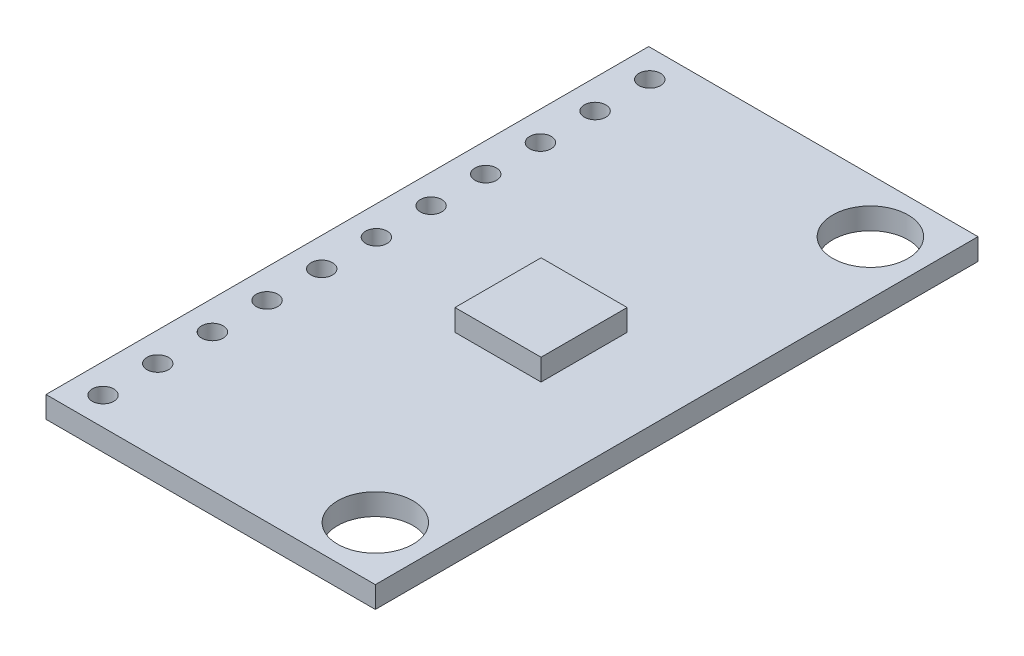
ISO-10303-21;
HEADER;
FILE_DESCRIPTION(('STEP AP214'),'2;1');
FILE_NAME('part.step','',(''),(''),'','','');
FILE_SCHEMA(('AUTOMOTIVE_DESIGN { 1 0 10303 214 1 1 1 1 }'));
ENDSEC;
DATA;
#1=APPLICATION_CONTEXT('core data for automotive mechanical design processes');
#2=APPLICATION_PROTOCOL_DEFINITION('international standard','automotive_design',2000,#1);
#3=PRODUCT_CONTEXT('',#1,'mechanical');
#4=PRODUCT('Part','Part','',(#3));
#5=PRODUCT_RELATED_PRODUCT_CATEGORY('part','',(#4));
#6=PRODUCT_DEFINITION_FORMATION('','',#4);
#7=PRODUCT_DEFINITION_CONTEXT('part definition',#1,'design');
#8=PRODUCT_DEFINITION('design','',#6,#7);
#9=PRODUCT_DEFINITION_SHAPE('','',#8);
#10=(LENGTH_UNIT() NAMED_UNIT(*) SI_UNIT(.MILLI.,.METRE.));
#11=(NAMED_UNIT(*) PLANE_ANGLE_UNIT() SI_UNIT($,.RADIAN.));
#12=(NAMED_UNIT(*) SI_UNIT($,.STERADIAN.) SOLID_ANGLE_UNIT());
#13=UNCERTAINTY_MEASURE_WITH_UNIT(LENGTH_MEASURE(1.E-05),#10,'distance_accuracy_value','');
#14=(GEOMETRIC_REPRESENTATION_CONTEXT(3) GLOBAL_UNCERTAINTY_ASSIGNED_CONTEXT((#13)) GLOBAL_UNIT_ASSIGNED_CONTEXT((#10,
#11,#12)) REPRESENTATION_CONTEXT('',''));
#15=CARTESIAN_POINT('',(0.,0.,0.));
#16=DIRECTION('',(0.,0.,1.));
#17=DIRECTION('',(1.,0.,0.));
#18=AXIS2_PLACEMENT_3D('',#15,#16,#17);
#19=CARTESIAN_POINT('',(0.,1.,0.));
#20=DIRECTION('',(0.,-1.,0.));
#21=DIRECTION('',(0.,0.,-1.));
#22=AXIS2_PLACEMENT_3D('',#19,#20,#21);
#23=PLANE('',#22);
#24=CARTESIAN_POINT('',(-7.65000000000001,1.,2.54));
#25=DIRECTION('',(0.,1.,0.));
#26=DIRECTION('',(0.,0.,-1.));
#27=AXIS2_PLACEMENT_3D('',#24,#25,#26);
#28=CIRCLE('',#27,0.500000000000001);
#29=CARTESIAN_POINT('',(-7.65000000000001,1.,2.04));
#30=VERTEX_POINT('',#29);
#31=EDGE_CURVE('E122',#30,#30,#28,.T.);
#32=ORIENTED_EDGE('',*,*,#31,.F.);
#33=EDGE_LOOP('',(#32));
#34=FACE_BOUND('',#33,.T.);
#35=CARTESIAN_POINT('',(-7.65000000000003,1.,7.62));
#36=DIRECTION('',(0.,1.,0.));
#37=DIRECTION('',(0.,0.,-1.));
#38=AXIS2_PLACEMENT_3D('',#35,#36,#37);
#39=CIRCLE('',#38,0.500000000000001);
#40=CARTESIAN_POINT('',(-7.65000000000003,1.,7.12));
#41=VERTEX_POINT('',#40);
#42=EDGE_CURVE('E137',#41,#41,#39,.T.);
#43=ORIENTED_EDGE('',*,*,#42,.F.);
#44=EDGE_LOOP('',(#43));
#45=FACE_BOUND('',#44,.T.);
#46=CARTESIAN_POINT('',(-7.65000000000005,1.,12.7));
#47=DIRECTION('',(0.,1.,0.));
#48=DIRECTION('',(0.,0.,-1.));
#49=AXIS2_PLACEMENT_3D('',#46,#47,#48);
#50=CIRCLE('',#49,0.500000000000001);
#51=CARTESIAN_POINT('',(-7.65000000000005,1.,12.2));
#52=VERTEX_POINT('',#51);
#53=EDGE_CURVE('E149',#52,#52,#50,.T.);
#54=ORIENTED_EDGE('',*,*,#53,.F.);
#55=EDGE_LOOP('',(#54));
#56=FACE_BOUND('',#55,.T.);
#57=CARTESIAN_POINT('',(-7.65000000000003,1.,-10.16));
#58=DIRECTION('',(0.,1.,0.));
#59=DIRECTION('',(0.,0.,1.));
#60=AXIS2_PLACEMENT_3D('',#57,#58,#59);
#61=CIRCLE('',#60,0.500000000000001);
#62=CARTESIAN_POINT('',(-7.65000000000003,1.,-9.66));
#63=VERTEX_POINT('',#62);
#64=EDGE_CURVE('E161',#63,#63,#61,.T.);
#65=ORIENTED_EDGE('',*,*,#64,.F.);
#66=EDGE_LOOP('',(#65));
#67=FACE_BOUND('',#66,.T.);
#68=CARTESIAN_POINT('',(-7.65000000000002,1.,-5.08));
#69=DIRECTION('',(0.,1.,0.));
#70=DIRECTION('',(0.,0.,1.));
#71=AXIS2_PLACEMENT_3D('',#68,#69,#70);
#72=CIRCLE('',#71,0.500000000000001);
#73=CARTESIAN_POINT('',(-7.65000000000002,1.,-4.58));
#74=VERTEX_POINT('',#73);
#75=EDGE_CURVE('E173',#74,#74,#72,.T.);
#76=ORIENTED_EDGE('',*,*,#75,.F.);
#77=EDGE_LOOP('',(#76));
#78=FACE_BOUND('',#77,.T.);
#79=CARTESIAN_POINT('',(-7.65,1.,0.));
#80=DIRECTION('',(0.,1.,0.));
#81=DIRECTION('',(0.,0.,1.));
#82=AXIS2_PLACEMENT_3D('',#79,#80,#81);
#83=CIRCLE('',#82,0.500000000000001);
#84=CARTESIAN_POINT('',(-7.65,1.,0.500000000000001));
#85=VERTEX_POINT('',#84);
#86=EDGE_CURVE('E185',#85,#85,#83,.T.);
#87=ORIENTED_EDGE('',*,*,#86,.F.);
#88=EDGE_LOOP('',(#87));
#89=FACE_BOUND('',#88,.T.);
#90=CARTESIAN_POINT('',(3.8,1.,-11.5));
#91=DIRECTION('',(0.,1.,0.));
#92=DIRECTION('',(0.,0.,1.));
#93=AXIS2_PLACEMENT_3D('',#90,#91,#92);
#94=CIRCLE('',#93,1.75);
#95=CARTESIAN_POINT('',(3.8,1.,-9.75));
#96=VERTEX_POINT('',#95);
#97=EDGE_CURVE('E197',#96,#96,#94,.T.);
#98=ORIENTED_EDGE('',*,*,#97,.F.);
#99=EDGE_LOOP('',(#98));
#100=FACE_BOUND('',#99,.T.);
#101=DIRECTION('',(0.,0.,-1.));
#102=VECTOR('',#101,1.);
#103=CARTESIAN_POINT('',(6.3,1.,14.));
#104=LINE('',#103,#102);
#105=CARTESIAN_POINT('',(6.3,1.,14.));
#106=VERTEX_POINT('',#105);
#107=CARTESIAN_POINT('',(6.3,1.,-14.));
#108=VERTEX_POINT('',#107);
#109=EDGE_CURVE('E203',#106,#108,#104,.T.);
#110=ORIENTED_EDGE('',*,*,#109,.T.);
#111=DIRECTION('',(-1.,0.,0.));
#112=VECTOR('',#111,1.);
#113=CARTESIAN_POINT('',(-9.,1.,-14.));
#114=LINE('',#113,#112);
#115=CARTESIAN_POINT('',(-9.,1.,-14.));
#116=VERTEX_POINT('',#115);
#117=EDGE_CURVE('E206',#108,#116,#114,.T.);
#118=ORIENTED_EDGE('',*,*,#117,.T.);
#119=DIRECTION('',(0.,0.,1.));
#120=VECTOR('',#119,1.);
#121=CARTESIAN_POINT('',(-9.,1.,14.));
#122=LINE('',#121,#120);
#123=CARTESIAN_POINT('',(-9.,1.,14.));
#124=VERTEX_POINT('',#123);
#125=EDGE_CURVE('E209',#116,#124,#122,.T.);
#126=ORIENTED_EDGE('',*,*,#125,.T.);
#127=DIRECTION('',(1.,0.,0.));
#128=VECTOR('',#127,1.);
#129=CARTESIAN_POINT('',(-9.,1.,14.));
#130=LINE('',#129,#128);
#131=EDGE_CURVE('E211',#124,#106,#130,.T.);
#132=ORIENTED_EDGE('',*,*,#131,.T.);
#133=EDGE_LOOP('',(#110,#118,#126,#132));
#134=FACE_BOUND('',#133,.T.);
#135=CARTESIAN_POINT('',(3.79999999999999,1.,11.5));
#136=DIRECTION('',(0.,1.,0.));
#137=DIRECTION('',(0.,0.,-1.));
#138=AXIS2_PLACEMENT_3D('',#135,#136,#137);
#139=CIRCLE('',#138,1.75);
#140=CARTESIAN_POINT('',(3.79999999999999,1.,9.75));
#141=VERTEX_POINT('',#140);
#142=EDGE_CURVE('E191',#141,#141,#139,.T.);
#143=ORIENTED_EDGE('',*,*,#142,.F.);
#144=EDGE_LOOP('',(#143));
#145=FACE_BOUND('',#144,.T.);
#146=CARTESIAN_POINT('',(-7.65000000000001,1.,-2.54));
#147=DIRECTION('',(0.,1.,0.));
#148=DIRECTION('',(0.,0.,1.));
#149=AXIS2_PLACEMENT_3D('',#146,#147,#148);
#150=CIRCLE('',#149,0.500000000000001);
#151=CARTESIAN_POINT('',(-7.65000000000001,1.,-2.04));
#152=VERTEX_POINT('',#151);
#153=EDGE_CURVE('E179',#152,#152,#150,.T.);
#154=ORIENTED_EDGE('',*,*,#153,.F.);
#155=EDGE_LOOP('',(#154));
#156=FACE_BOUND('',#155,.T.);
#157=CARTESIAN_POINT('',(-7.65000000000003,1.,-7.62));
#158=DIRECTION('',(0.,1.,0.));
#159=DIRECTION('',(0.,0.,1.));
#160=AXIS2_PLACEMENT_3D('',#157,#158,#159);
#161=CIRCLE('',#160,0.500000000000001);
#162=CARTESIAN_POINT('',(-7.65000000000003,1.,-7.12));
#163=VERTEX_POINT('',#162);
#164=EDGE_CURVE('E167',#163,#163,#161,.T.);
#165=ORIENTED_EDGE('',*,*,#164,.F.);
#166=EDGE_LOOP('',(#165));
#167=FACE_BOUND('',#166,.T.);
#168=CARTESIAN_POINT('',(-7.65000000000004,1.,-12.7));
#169=DIRECTION('',(0.,1.,0.));
#170=DIRECTION('',(0.,0.,1.));
#171=AXIS2_PLACEMENT_3D('',#168,#169,#170);
#172=CIRCLE('',#171,0.500000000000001);
#173=CARTESIAN_POINT('',(-7.65000000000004,1.,-12.2));
#174=VERTEX_POINT('',#173);
#175=EDGE_CURVE('E155',#174,#174,#172,.T.);
#176=ORIENTED_EDGE('',*,*,#175,.F.);
#177=EDGE_LOOP('',(#176));
#178=FACE_BOUND('',#177,.T.);
#179=CARTESIAN_POINT('',(-7.65000000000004,1.,10.16));
#180=DIRECTION('',(0.,1.,0.));
#181=DIRECTION('',(0.,0.,-1.));
#182=AXIS2_PLACEMENT_3D('',#179,#180,#181);
#183=CIRCLE('',#182,0.500000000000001);
#184=CARTESIAN_POINT('',(-7.65000000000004,1.,9.66));
#185=VERTEX_POINT('',#184);
#186=EDGE_CURVE('E143',#185,#185,#183,.T.);
#187=ORIENTED_EDGE('',*,*,#186,.F.);
#188=EDGE_LOOP('',(#187));
#189=FACE_BOUND('',#188,.T.);
#190=CARTESIAN_POINT('',(-7.65000000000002,1.,5.08));
#191=DIRECTION('',(0.,1.,0.));
#192=DIRECTION('',(0.,0.,-1.));
#193=AXIS2_PLACEMENT_3D('',#190,#191,#192);
#194=CIRCLE('',#193,0.500000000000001);
#195=CARTESIAN_POINT('',(-7.65000000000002,1.,4.58));
#196=VERTEX_POINT('',#195);
#197=EDGE_CURVE('E131',#196,#196,#194,.T.);
#198=ORIENTED_EDGE('',*,*,#197,.F.);
#199=EDGE_LOOP('',(#198));
#200=FACE_BOUND('',#199,.T.);
#201=DIRECTION('',(0.,0.,-1.));
#202=VECTOR('',#201,1.);
#203=CARTESIAN_POINT('',(2.,1.,-2.));
#204=LINE('',#203,#202);
#205=CARTESIAN_POINT('',(2.,1.,2.));
#206=VERTEX_POINT('',#205);
#207=CARTESIAN_POINT('',(2.,1.,-2.));
#208=VERTEX_POINT('',#207);
#209=EDGE_CURVE('E118',#206,#208,#204,.T.);
#210=ORIENTED_EDGE('',*,*,#209,.F.);
#211=DIRECTION('',(1.,0.,0.));
#212=VECTOR('',#211,1.);
#213=CARTESIAN_POINT('',(-2.,1.,2.));
#214=LINE('',#213,#212);
#215=CARTESIAN_POINT('',(-2.,1.,2.));
#216=VERTEX_POINT('',#215);
#217=EDGE_CURVE('E115',#216,#206,#214,.T.);
#218=ORIENTED_EDGE('',*,*,#217,.F.);
#219=DIRECTION('',(0.,0.,1.));
#220=VECTOR('',#219,1.);
#221=CARTESIAN_POINT('',(-2.,1.,-2.));
#222=LINE('',#221,#220);
#223=CARTESIAN_POINT('',(-2.,1.,-2.));
#224=VERTEX_POINT('',#223);
#225=EDGE_CURVE('E53',#224,#216,#222,.T.);
#226=ORIENTED_EDGE('',*,*,#225,.F.);
#227=DIRECTION('',(-1.,0.,0.));
#228=VECTOR('',#227,1.);
#229=CARTESIAN_POINT('',(-2.,1.,-2.));
#230=LINE('',#229,#228);
#231=EDGE_CURVE('E48',#208,#224,#230,.T.);
#232=ORIENTED_EDGE('',*,*,#231,.F.);
#233=EDGE_LOOP('',(#210,#218,#226,#232));
#234=FACE_BOUND('',#233,.T.);
#235=ADVANCED_FACE('F33',(#34,#45,#56,#67,#78,#89,#100,#134,#145,#156,#167,#178,#189,#200,#234),
#23,.F.);
#236=CARTESIAN_POINT('',(0.,0.,0.));
#237=DIRECTION('',(0.,-1.,0.));
#238=DIRECTION('',(0.,0.,-1.));
#239=AXIS2_PLACEMENT_3D('',#236,#237,#238);
#240=PLANE('',#239);
#241=CARTESIAN_POINT('',(-7.65000000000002,0.,5.08));
#242=DIRECTION('',(0.,1.,0.));
#243=DIRECTION('',(0.,0.,-1.));
#244=AXIS2_PLACEMENT_3D('',#241,#242,#243);
#245=CIRCLE('',#244,0.500000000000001);
#246=CARTESIAN_POINT('',(-7.65000000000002,0.,4.58));
#247=VERTEX_POINT('',#246);
#248=EDGE_CURVE('E129',#247,#247,#245,.T.);
#249=ORIENTED_EDGE('',*,*,#248,.T.);
#250=EDGE_LOOP('',(#249));
#251=FACE_BOUND('',#250,.T.);
#252=CARTESIAN_POINT('',(-7.65000000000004,0.,10.16));
#253=DIRECTION('',(0.,1.,0.));
#254=DIRECTION('',(0.,0.,-1.));
#255=AXIS2_PLACEMENT_3D('',#252,#253,#254);
#256=CIRCLE('',#255,0.500000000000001);
#257=CARTESIAN_POINT('',(-7.65000000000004,0.,9.66));
#258=VERTEX_POINT('',#257);
#259=EDGE_CURVE('E140',#258,#258,#256,.T.);
#260=ORIENTED_EDGE('',*,*,#259,.T.);
#261=EDGE_LOOP('',(#260));
#262=FACE_BOUND('',#261,.T.);
#263=CARTESIAN_POINT('',(-7.65000000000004,0.,-12.7));
#264=DIRECTION('',(0.,1.,0.));
#265=DIRECTION('',(0.,0.,1.));
#266=AXIS2_PLACEMENT_3D('',#263,#264,#265);
#267=CIRCLE('',#266,0.500000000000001);
#268=CARTESIAN_POINT('',(-7.65000000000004,0.,-12.2));
#269=VERTEX_POINT('',#268);
#270=EDGE_CURVE('E152',#269,#269,#267,.T.);
#271=ORIENTED_EDGE('',*,*,#270,.T.);
#272=EDGE_LOOP('',(#271));
#273=FACE_BOUND('',#272,.T.);
#274=CARTESIAN_POINT('',(-7.65000000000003,0.,-7.62));
#275=DIRECTION('',(0.,1.,0.));
#276=DIRECTION('',(0.,0.,1.));
#277=AXIS2_PLACEMENT_3D('',#274,#275,#276);
#278=CIRCLE('',#277,0.500000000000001);
#279=CARTESIAN_POINT('',(-7.65000000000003,0.,-7.12));
#280=VERTEX_POINT('',#279);
#281=EDGE_CURVE('E164',#280,#280,#278,.T.);
#282=ORIENTED_EDGE('',*,*,#281,.T.);
#283=EDGE_LOOP('',(#282));
#284=FACE_BOUND('',#283,.T.);
#285=CARTESIAN_POINT('',(-7.65000000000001,0.,-2.54));
#286=DIRECTION('',(0.,1.,0.));
#287=DIRECTION('',(0.,0.,1.));
#288=AXIS2_PLACEMENT_3D('',#285,#286,#287);
#289=CIRCLE('',#288,0.500000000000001);
#290=CARTESIAN_POINT('',(-7.65000000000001,0.,-2.04));
#291=VERTEX_POINT('',#290);
#292=EDGE_CURVE('E176',#291,#291,#289,.T.);
#293=ORIENTED_EDGE('',*,*,#292,.T.);
#294=EDGE_LOOP('',(#293));
#295=FACE_BOUND('',#294,.T.);
#296=CARTESIAN_POINT('',(3.79999999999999,0.,11.5));
#297=DIRECTION('',(0.,1.,0.));
#298=DIRECTION('',(0.,0.,-1.));
#299=AXIS2_PLACEMENT_3D('',#296,#297,#298);
#300=CIRCLE('',#299,1.75);
#301=CARTESIAN_POINT('',(3.79999999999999,0.,9.75));
#302=VERTEX_POINT('',#301);
#303=EDGE_CURVE('E188',#302,#302,#300,.T.);
#304=ORIENTED_EDGE('',*,*,#303,.T.);
#305=EDGE_LOOP('',(#304));
#306=FACE_BOUND('',#305,.T.);
#307=DIRECTION('',(0.,0.,-1.));
#308=VECTOR('',#307,1.);
#309=CARTESIAN_POINT('',(6.3,0.,14.));
#310=LINE('',#309,#308);
#311=CARTESIAN_POINT('',(6.3,0.,14.));
#312=VERTEX_POINT('',#311);
#313=CARTESIAN_POINT('',(6.3,0.,-14.));
#314=VERTEX_POINT('',#313);
#315=EDGE_CURVE('E200',#312,#314,#310,.T.);
#316=ORIENTED_EDGE('',*,*,#315,.F.);
#317=DIRECTION('',(1.,0.,0.));
#318=VECTOR('',#317,1.);
#319=CARTESIAN_POINT('',(-9.,0.,14.));
#320=LINE('',#319,#318);
#321=CARTESIAN_POINT('',(-9.,0.,14.));
#322=VERTEX_POINT('',#321);
#323=EDGE_CURVE('E207',#322,#312,#320,.T.);
#324=ORIENTED_EDGE('',*,*,#323,.F.);
#325=DIRECTION('',(0.,0.,1.));
#326=VECTOR('',#325,1.);
#327=CARTESIAN_POINT('',(-9.,0.,14.));
#328=LINE('',#327,#326);
#329=CARTESIAN_POINT('',(-9.,0.,-14.));
#330=VERTEX_POINT('',#329);
#331=EDGE_CURVE('E218',#330,#322,#328,.T.);
#332=ORIENTED_EDGE('',*,*,#331,.F.);
#333=DIRECTION('',(-1.,0.,0.));
#334=VECTOR('',#333,1.);
#335=CARTESIAN_POINT('',(-9.,0.,-14.));
#336=LINE('',#335,#334);
#337=EDGE_CURVE('E216',#314,#330,#336,.T.);
#338=ORIENTED_EDGE('',*,*,#337,.F.);
#339=EDGE_LOOP('',(#316,#324,#332,#338));
#340=FACE_BOUND('',#339,.T.);
#341=CARTESIAN_POINT('',(3.8,0.,-11.5));
#342=DIRECTION('',(0.,1.,0.));
#343=DIRECTION('',(0.,0.,1.));
#344=AXIS2_PLACEMENT_3D('',#341,#342,#343);
#345=CIRCLE('',#344,1.75);
#346=CARTESIAN_POINT('',(3.8,0.,-9.75));
#347=VERTEX_POINT('',#346);
#348=EDGE_CURVE('E194',#347,#347,#345,.T.);
#349=ORIENTED_EDGE('',*,*,#348,.T.);
#350=EDGE_LOOP('',(#349));
#351=FACE_BOUND('',#350,.T.);
#352=CARTESIAN_POINT('',(-7.65,0.,0.));
#353=DIRECTION('',(0.,1.,0.));
#354=DIRECTION('',(0.,0.,1.));
#355=AXIS2_PLACEMENT_3D('',#352,#353,#354);
#356=CIRCLE('',#355,0.500000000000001);
#357=CARTESIAN_POINT('',(-7.65,0.,0.500000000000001));
#358=VERTEX_POINT('',#357);
#359=EDGE_CURVE('E182',#358,#358,#356,.T.);
#360=ORIENTED_EDGE('',*,*,#359,.T.);
#361=EDGE_LOOP('',(#360));
#362=FACE_BOUND('',#361,.T.);
#363=CARTESIAN_POINT('',(-7.65000000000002,0.,-5.08));
#364=DIRECTION('',(0.,1.,0.));
#365=DIRECTION('',(0.,0.,1.));
#366=AXIS2_PLACEMENT_3D('',#363,#364,#365);
#367=CIRCLE('',#366,0.500000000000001);
#368=CARTESIAN_POINT('',(-7.65000000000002,0.,-4.58));
#369=VERTEX_POINT('',#368);
#370=EDGE_CURVE('E170',#369,#369,#367,.T.);
#371=ORIENTED_EDGE('',*,*,#370,.T.);
#372=EDGE_LOOP('',(#371));
#373=FACE_BOUND('',#372,.T.);
#374=CARTESIAN_POINT('',(-7.65000000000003,0.,-10.16));
#375=DIRECTION('',(0.,1.,0.));
#376=DIRECTION('',(0.,0.,1.));
#377=AXIS2_PLACEMENT_3D('',#374,#375,#376);
#378=CIRCLE('',#377,0.500000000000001);
#379=CARTESIAN_POINT('',(-7.65000000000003,0.,-9.66));
#380=VERTEX_POINT('',#379);
#381=EDGE_CURVE('E158',#380,#380,#378,.T.);
#382=ORIENTED_EDGE('',*,*,#381,.T.);
#383=EDGE_LOOP('',(#382));
#384=FACE_BOUND('',#383,.T.);
#385=CARTESIAN_POINT('',(-7.65000000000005,0.,12.7));
#386=DIRECTION('',(0.,1.,0.));
#387=DIRECTION('',(0.,0.,-1.));
#388=AXIS2_PLACEMENT_3D('',#385,#386,#387);
#389=CIRCLE('',#388,0.500000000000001);
#390=CARTESIAN_POINT('',(-7.65000000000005,0.,12.2));
#391=VERTEX_POINT('',#390);
#392=EDGE_CURVE('E146',#391,#391,#389,.T.);
#393=ORIENTED_EDGE('',*,*,#392,.T.);
#394=EDGE_LOOP('',(#393));
#395=FACE_BOUND('',#394,.T.);
#396=CARTESIAN_POINT('',(-7.65000000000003,0.,7.62));
#397=DIRECTION('',(0.,1.,0.));
#398=DIRECTION('',(0.,0.,-1.));
#399=AXIS2_PLACEMENT_3D('',#396,#397,#398);
#400=CIRCLE('',#399,0.500000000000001);
#401=CARTESIAN_POINT('',(-7.65000000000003,0.,7.12));
#402=VERTEX_POINT('',#401);
#403=EDGE_CURVE('E134',#402,#402,#400,.T.);
#404=ORIENTED_EDGE('',*,*,#403,.T.);
#405=EDGE_LOOP('',(#404));
#406=FACE_BOUND('',#405,.T.);
#407=CARTESIAN_POINT('',(-7.65000000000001,0.,2.54));
#408=DIRECTION('',(0.,1.,0.));
#409=DIRECTION('',(0.,0.,-1.));
#410=AXIS2_PLACEMENT_3D('',#407,#408,#409);
#411=CIRCLE('',#410,0.500000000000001);
#412=CARTESIAN_POINT('',(-7.65000000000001,0.,2.04));
#413=VERTEX_POINT('',#412);
#414=EDGE_CURVE('E119',#413,#413,#411,.T.);
#415=ORIENTED_EDGE('',*,*,#414,.T.);
#416=EDGE_LOOP('',(#415));
#417=FACE_BOUND('',#416,.T.);
#418=ADVANCED_FACE('F236',(#251,#262,#273,#284,#295,#306,#340,#351,#362,#373,#384,#395,#406,
#417),#240,.T.);
#419=CARTESIAN_POINT('',(6.3,1.,14.));
#420=DIRECTION('',(-1.,0.,0.));
#421=DIRECTION('',(0.,0.,1.));
#422=AXIS2_PLACEMENT_3D('',#419,#420,#421);
#423=PLANE('',#422);
#424=ORIENTED_EDGE('',*,*,#315,.T.);
#425=DIRECTION('',(0.,-1.,0.));
#426=VECTOR('',#425,1.);
#427=CARTESIAN_POINT('',(6.3,1.,-14.));
#428=LINE('',#427,#426);
#429=EDGE_CURVE('E11',#108,#314,#428,.T.);
#430=ORIENTED_EDGE('',*,*,#429,.F.);
#431=ORIENTED_EDGE('',*,*,#109,.F.);
#432=DIRECTION('',(0.,-1.,0.));
#433=VECTOR('',#432,1.);
#434=CARTESIAN_POINT('',(6.3,1.,14.));
#435=LINE('',#434,#433);
#436=EDGE_CURVE('E213',#106,#312,#435,.T.);
#437=ORIENTED_EDGE('',*,*,#436,.T.);
#438=EDGE_LOOP('',(#424,#430,#431,#437));
#439=FACE_BOUND('',#438,.T.);
#440=ADVANCED_FACE('F35',(#439),#423,.F.);
#441=CARTESIAN_POINT('',(-9.,1.,-14.));
#442=DIRECTION('',(0.,0.,1.));
#443=DIRECTION('',(1.,0.,0.));
#444=AXIS2_PLACEMENT_3D('',#441,#442,#443);
#445=PLANE('',#444);
#446=ORIENTED_EDGE('',*,*,#337,.T.);
#447=DIRECTION('',(0.,-1.,0.));
#448=VECTOR('',#447,1.);
#449=CARTESIAN_POINT('',(-9.,1.,-14.));
#450=LINE('',#449,#448);
#451=EDGE_CURVE('E41',#116,#330,#450,.T.);
#452=ORIENTED_EDGE('',*,*,#451,.F.);
#453=ORIENTED_EDGE('',*,*,#117,.F.);
#454=ORIENTED_EDGE('',*,*,#429,.T.);
#455=EDGE_LOOP('',(#446,#452,#453,#454));
#456=FACE_BOUND('',#455,.T.);
#457=ADVANCED_FACE('F247',(#456),#445,.F.);
#458=CARTESIAN_POINT('',(-9.,1.,14.));
#459=DIRECTION('',(1.,0.,0.));
#460=DIRECTION('',(0.,0.,-1.));
#461=AXIS2_PLACEMENT_3D('',#458,#459,#460);
#462=PLANE('',#461);
#463=ORIENTED_EDGE('',*,*,#331,.T.);
#464=DIRECTION('',(0.,-1.,0.));
#465=VECTOR('',#464,1.);
#466=CARTESIAN_POINT('',(-9.,1.,14.));
#467=LINE('',#466,#465);
#468=EDGE_CURVE('E223',#124,#322,#467,.T.);
#469=ORIENTED_EDGE('',*,*,#468,.F.);
#470=ORIENTED_EDGE('',*,*,#125,.F.);
#471=ORIENTED_EDGE('',*,*,#451,.T.);
#472=EDGE_LOOP('',(#463,#469,#470,#471));
#473=FACE_BOUND('',#472,.T.);
#474=ADVANCED_FACE('F230',(#473),#462,.F.);
#475=CARTESIAN_POINT('',(-9.,1.,14.));
#476=DIRECTION('',(0.,0.,-1.));
#477=DIRECTION('',(-1.,0.,0.));
#478=AXIS2_PLACEMENT_3D('',#475,#476,#477);
#479=PLANE('',#478);
#480=ORIENTED_EDGE('',*,*,#323,.T.);
#481=ORIENTED_EDGE('',*,*,#436,.F.);
#482=ORIENTED_EDGE('',*,*,#131,.F.);
#483=ORIENTED_EDGE('',*,*,#468,.T.);
#484=EDGE_LOOP('',(#480,#481,#482,#483));
#485=FACE_BOUND('',#484,.T.);
#486=ADVANCED_FACE('F240',(#485),#479,.F.);
#487=CARTESIAN_POINT('',(3.8,1.,-11.5));
#488=DIRECTION('',(0.,-1.,0.));
#489=DIRECTION('',(0.,0.,-1.));
#490=AXIS2_PLACEMENT_3D('',#487,#488,#489);
#491=CYLINDRICAL_SURFACE('',#490,1.75);
#492=ORIENTED_EDGE('',*,*,#97,.T.);
#493=EDGE_LOOP('',(#492));
#494=FACE_BOUND('',#493,.T.);
#495=ORIENTED_EDGE('',*,*,#348,.F.);
#496=EDGE_LOOP('',(#495));
#497=FACE_BOUND('',#496,.T.);
#498=ADVANCED_FACE('F265',(#494,#497),#491,.F.);
#499=CARTESIAN_POINT('',(3.79999999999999,1.,11.5));
#500=DIRECTION('',(0.,-1.,0.));
#501=DIRECTION('',(0.,0.,-1.));
#502=AXIS2_PLACEMENT_3D('',#499,#500,#501);
#503=CYLINDRICAL_SURFACE('',#502,1.75);
#504=ORIENTED_EDGE('',*,*,#142,.T.);
#505=EDGE_LOOP('',(#504));
#506=FACE_BOUND('',#505,.T.);
#507=ORIENTED_EDGE('',*,*,#303,.F.);
#508=EDGE_LOOP('',(#507));
#509=FACE_BOUND('',#508,.T.);
#510=ADVANCED_FACE('F272',(#506,#509),#503,.F.);
#511=CARTESIAN_POINT('',(-7.65,1.,0.));
#512=DIRECTION('',(0.,-1.,0.));
#513=DIRECTION('',(0.,0.,-1.));
#514=AXIS2_PLACEMENT_3D('',#511,#512,#513);
#515=CYLINDRICAL_SURFACE('',#514,0.500000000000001);
#516=ORIENTED_EDGE('',*,*,#86,.T.);
#517=EDGE_LOOP('',(#516));
#518=FACE_BOUND('',#517,.T.);
#519=ORIENTED_EDGE('',*,*,#359,.F.);
#520=EDGE_LOOP('',(#519));
#521=FACE_BOUND('',#520,.T.);
#522=ADVANCED_FACE('F277',(#518,#521),#515,.F.);
#523=CARTESIAN_POINT('',(-7.65000000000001,1.,-2.54));
#524=DIRECTION('',(0.,-1.,0.));
#525=DIRECTION('',(0.,0.,-1.));
#526=AXIS2_PLACEMENT_3D('',#523,#524,#525);
#527=CYLINDRICAL_SURFACE('',#526,0.500000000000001);
#528=ORIENTED_EDGE('',*,*,#153,.T.);
#529=EDGE_LOOP('',(#528));
#530=FACE_BOUND('',#529,.T.);
#531=ORIENTED_EDGE('',*,*,#292,.F.);
#532=EDGE_LOOP('',(#531));
#533=FACE_BOUND('',#532,.T.);
#534=ADVANCED_FACE('F336',(#530,#533),#527,.F.);
#535=CARTESIAN_POINT('',(-7.65000000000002,1.,-5.08));
#536=DIRECTION('',(0.,-1.,0.));
#537=DIRECTION('',(0.,0.,-1.));
#538=AXIS2_PLACEMENT_3D('',#535,#536,#537);
#539=CYLINDRICAL_SURFACE('',#538,0.500000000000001);
#540=ORIENTED_EDGE('',*,*,#75,.T.);
#541=EDGE_LOOP('',(#540));
#542=FACE_BOUND('',#541,.T.);
#543=ORIENTED_EDGE('',*,*,#370,.F.);
#544=EDGE_LOOP('',(#543));
#545=FACE_BOUND('',#544,.T.);
#546=ADVANCED_FACE('F332',(#542,#545),#539,.F.);
#547=CARTESIAN_POINT('',(-7.65000000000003,1.,-7.62));
#548=DIRECTION('',(0.,-1.,0.));
#549=DIRECTION('',(0.,0.,-1.));
#550=AXIS2_PLACEMENT_3D('',#547,#548,#549);
#551=CYLINDRICAL_SURFACE('',#550,0.500000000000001);
#552=ORIENTED_EDGE('',*,*,#164,.T.);
#553=EDGE_LOOP('',(#552));
#554=FACE_BOUND('',#553,.T.);
#555=ORIENTED_EDGE('',*,*,#281,.F.);
#556=EDGE_LOOP('',(#555));
#557=FACE_BOUND('',#556,.T.);
#558=ADVANCED_FACE('F328',(#554,#557),#551,.F.);
#559=CARTESIAN_POINT('',(-7.65000000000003,1.,-10.16));
#560=DIRECTION('',(0.,-1.,0.));
#561=DIRECTION('',(0.,0.,-1.));
#562=AXIS2_PLACEMENT_3D('',#559,#560,#561);
#563=CYLINDRICAL_SURFACE('',#562,0.500000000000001);
#564=ORIENTED_EDGE('',*,*,#64,.T.);
#565=EDGE_LOOP('',(#564));
#566=FACE_BOUND('',#565,.T.);
#567=ORIENTED_EDGE('',*,*,#381,.F.);
#568=EDGE_LOOP('',(#567));
#569=FACE_BOUND('',#568,.T.);
#570=ADVANCED_FACE('F324',(#566,#569),#563,.F.);
#571=CARTESIAN_POINT('',(-7.65000000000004,1.,-12.7));
#572=DIRECTION('',(0.,-1.,0.));
#573=DIRECTION('',(0.,0.,-1.));
#574=AXIS2_PLACEMENT_3D('',#571,#572,#573);
#575=CYLINDRICAL_SURFACE('',#574,0.500000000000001);
#576=ORIENTED_EDGE('',*,*,#175,.T.);
#577=EDGE_LOOP('',(#576));
#578=FACE_BOUND('',#577,.T.);
#579=ORIENTED_EDGE('',*,*,#270,.F.);
#580=EDGE_LOOP('',(#579));
#581=FACE_BOUND('',#580,.T.);
#582=ADVANCED_FACE('F320',(#578,#581),#575,.F.);
#583=CARTESIAN_POINT('',(-7.65000000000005,1.,12.7));
#584=DIRECTION('',(0.,-1.,0.));
#585=DIRECTION('',(0.,0.,-1.));
#586=AXIS2_PLACEMENT_3D('',#583,#584,#585);
#587=CYLINDRICAL_SURFACE('',#586,0.500000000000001);
#588=ORIENTED_EDGE('',*,*,#53,.T.);
#589=EDGE_LOOP('',(#588));
#590=FACE_BOUND('',#589,.T.);
#591=ORIENTED_EDGE('',*,*,#392,.F.);
#592=EDGE_LOOP('',(#591));
#593=FACE_BOUND('',#592,.T.);
#594=ADVANCED_FACE('F316',(#590,#593),#587,.F.);
#595=CARTESIAN_POINT('',(-7.65000000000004,1.,10.16));
#596=DIRECTION('',(0.,-1.,0.));
#597=DIRECTION('',(0.,0.,-1.));
#598=AXIS2_PLACEMENT_3D('',#595,#596,#597);
#599=CYLINDRICAL_SURFACE('',#598,0.500000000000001);
#600=ORIENTED_EDGE('',*,*,#186,.T.);
#601=EDGE_LOOP('',(#600));
#602=FACE_BOUND('',#601,.T.);
#603=ORIENTED_EDGE('',*,*,#259,.F.);
#604=EDGE_LOOP('',(#603));
#605=FACE_BOUND('',#604,.T.);
#606=ADVANCED_FACE('F312',(#602,#605),#599,.F.);
#607=CARTESIAN_POINT('',(-7.65000000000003,1.,7.62));
#608=DIRECTION('',(0.,-1.,0.));
#609=DIRECTION('',(0.,0.,-1.));
#610=AXIS2_PLACEMENT_3D('',#607,#608,#609);
#611=CYLINDRICAL_SURFACE('',#610,0.500000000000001);
#612=ORIENTED_EDGE('',*,*,#42,.T.);
#613=EDGE_LOOP('',(#612));
#614=FACE_BOUND('',#613,.T.);
#615=ORIENTED_EDGE('',*,*,#403,.F.);
#616=EDGE_LOOP('',(#615));
#617=FACE_BOUND('',#616,.T.);
#618=ADVANCED_FACE('F305',(#614,#617),#611,.F.);
#619=CARTESIAN_POINT('',(-7.65000000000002,1.,5.08));
#620=DIRECTION('',(0.,-1.,0.));
#621=DIRECTION('',(0.,0.,-1.));
#622=AXIS2_PLACEMENT_3D('',#619,#620,#621);
#623=CYLINDRICAL_SURFACE('',#622,0.500000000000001);
#624=ORIENTED_EDGE('',*,*,#197,.T.);
#625=EDGE_LOOP('',(#624));
#626=FACE_BOUND('',#625,.T.);
#627=ORIENTED_EDGE('',*,*,#248,.F.);
#628=EDGE_LOOP('',(#627));
#629=FACE_BOUND('',#628,.T.);
#630=ADVANCED_FACE('F297',(#626,#629),#623,.F.);
#631=CARTESIAN_POINT('',(-7.65000000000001,1.,2.54));
#632=DIRECTION('',(0.,-1.,0.));
#633=DIRECTION('',(0.,0.,-1.));
#634=AXIS2_PLACEMENT_3D('',#631,#632,#633);
#635=CYLINDRICAL_SURFACE('',#634,0.500000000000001);
#636=ORIENTED_EDGE('',*,*,#31,.T.);
#637=EDGE_LOOP('',(#636));
#638=FACE_BOUND('',#637,.T.);
#639=ORIENTED_EDGE('',*,*,#414,.F.);
#640=EDGE_LOOP('',(#639));
#641=FACE_BOUND('',#640,.T.);
#642=ADVANCED_FACE('F295',(#638,#641),#635,.F.);
#643=CARTESIAN_POINT('',(2.,2.,-2.));
#644=DIRECTION('',(-1.,0.,0.));
#645=DIRECTION('',(0.,0.,1.));
#646=AXIS2_PLACEMENT_3D('',#643,#644,#645);
#647=PLANE('',#646);
#648=ORIENTED_EDGE('',*,*,#209,.T.);
#649=DIRECTION('',(0.,-1.,0.));
#650=VECTOR('',#649,1.);
#651=CARTESIAN_POINT('',(2.,2.,-2.));
#652=LINE('',#651,#650);
#653=CARTESIAN_POINT('',(2.,2.,-2.));
#654=VERTEX_POINT('',#653);
#655=EDGE_CURVE('E99',#654,#208,#652,.T.);
#656=ORIENTED_EDGE('',*,*,#655,.F.);
#657=DIRECTION('',(0.,0.,-1.));
#658=VECTOR('',#657,1.);
#659=CARTESIAN_POINT('',(2.,2.,-2.));
#660=LINE('',#659,#658);
#661=CARTESIAN_POINT('',(2.,2.,2.));
#662=VERTEX_POINT('',#661);
#663=EDGE_CURVE('E106',#662,#654,#660,.T.);
#664=ORIENTED_EDGE('',*,*,#663,.F.);
#665=DIRECTION('',(0.,-1.,0.));
#666=VECTOR('',#665,1.);
#667=CARTESIAN_POINT('',(2.,2.,2.));
#668=LINE('',#667,#666);
#669=EDGE_CURVE('E442',#662,#206,#668,.T.);
#670=ORIENTED_EDGE('',*,*,#669,.T.);
#671=EDGE_LOOP('',(#648,#656,#664,#670));
#672=FACE_BOUND('',#671,.T.);
#673=ADVANCED_FACE('F117',(#672),#647,.F.);
#674=CARTESIAN_POINT('',(-2.,2.,-2.));
#675=DIRECTION('',(0.,0.,1.));
#676=DIRECTION('',(1.,0.,0.));
#677=AXIS2_PLACEMENT_3D('',#674,#675,#676);
#678=PLANE('',#677);
#679=ORIENTED_EDGE('',*,*,#231,.T.);
#680=DIRECTION('',(0.,-1.,0.));
#681=VECTOR('',#680,1.);
#682=CARTESIAN_POINT('',(-2.,2.,-2.));
#683=LINE('',#682,#681);
#684=CARTESIAN_POINT('',(-2.,2.,-2.));
#685=VERTEX_POINT('',#684);
#686=EDGE_CURVE('E102',#685,#224,#683,.T.);
#687=ORIENTED_EDGE('',*,*,#686,.F.);
#688=DIRECTION('',(-1.,0.,0.));
#689=VECTOR('',#688,1.);
#690=CARTESIAN_POINT('',(-2.,2.,-2.));
#691=LINE('',#690,#689);
#692=EDGE_CURVE('E95',#654,#685,#691,.T.);
#693=ORIENTED_EDGE('',*,*,#692,.F.);
#694=ORIENTED_EDGE('',*,*,#655,.T.);
#695=EDGE_LOOP('',(#679,#687,#693,#694));
#696=FACE_BOUND('',#695,.T.);
#697=ADVANCED_FACE('F97',(#696),#678,.F.);
#698=CARTESIAN_POINT('',(-2.,2.,-2.));
#699=DIRECTION('',(1.,0.,0.));
#700=DIRECTION('',(0.,0.,-1.));
#701=AXIS2_PLACEMENT_3D('',#698,#699,#700);
#702=PLANE('',#701);
#703=ORIENTED_EDGE('',*,*,#225,.T.);
#704=DIRECTION('',(0.,-1.,0.));
#705=VECTOR('',#704,1.);
#706=CARTESIAN_POINT('',(-2.,2.,2.));
#707=LINE('',#706,#705);
#708=CARTESIAN_POINT('',(-2.,2.,2.));
#709=VERTEX_POINT('',#708);
#710=EDGE_CURVE('E124',#709,#216,#707,.T.);
#711=ORIENTED_EDGE('',*,*,#710,.F.);
#712=DIRECTION('',(0.,0.,1.));
#713=VECTOR('',#712,1.);
#714=CARTESIAN_POINT('',(-2.,2.,-2.));
#715=LINE('',#714,#713);
#716=EDGE_CURVE('E105',#685,#709,#715,.T.);
#717=ORIENTED_EDGE('',*,*,#716,.F.);
#718=ORIENTED_EDGE('',*,*,#686,.T.);
#719=EDGE_LOOP('',(#703,#711,#717,#718));
#720=FACE_BOUND('',#719,.T.);
#721=ADVANCED_FACE('F410',(#720),#702,.F.);
#722=CARTESIAN_POINT('',(-2.,2.,2.));
#723=DIRECTION('',(0.,0.,-1.));
#724=DIRECTION('',(-1.,0.,0.));
#725=AXIS2_PLACEMENT_3D('',#722,#723,#724);
#726=PLANE('',#725);
#727=ORIENTED_EDGE('',*,*,#217,.T.);
#728=ORIENTED_EDGE('',*,*,#669,.F.);
#729=DIRECTION('',(1.,0.,0.));
#730=VECTOR('',#729,1.);
#731=CARTESIAN_POINT('',(-2.,2.,2.));
#732=LINE('',#731,#730);
#733=EDGE_CURVE('E111',#709,#662,#732,.T.);
#734=ORIENTED_EDGE('',*,*,#733,.F.);
#735=ORIENTED_EDGE('',*,*,#710,.T.);
#736=EDGE_LOOP('',(#727,#728,#734,#735));
#737=FACE_BOUND('',#736,.T.);
#738=ADVANCED_FACE('F418',(#737),#726,.F.);
#739=CARTESIAN_POINT('',(0.,2.,0.));
#740=DIRECTION('',(0.,1.,0.));
#741=DIRECTION('',(0.,0.,1.));
#742=AXIS2_PLACEMENT_3D('',#739,#740,#741);
#743=PLANE('',#742);
#744=ORIENTED_EDGE('',*,*,#663,.T.);
#745=ORIENTED_EDGE('',*,*,#692,.T.);
#746=ORIENTED_EDGE('',*,*,#716,.T.);
#747=ORIENTED_EDGE('',*,*,#733,.T.);
#748=EDGE_LOOP('',(#744,#745,#746,#747));
#749=FACE_BOUND('',#748,.T.);
#750=ADVANCED_FACE('F109',(#749),#743,.T.);
#751=CLOSED_SHELL('',(#235,#418,#440,#457,#474,#486,#498,#510,#522,#534,#546,#558,#570,#582,
#594,#606,#618,#630,#642,#673,#697,#721,#738,#750));
#752=MANIFOLD_SOLID_BREP('B2',#751);
#753=ADVANCED_BREP_SHAPE_REPRESENTATION('',(#18,#752),#14);
#754=SHAPE_DEFINITION_REPRESENTATION(#9,#753);
ENDSEC;
END-ISO-10303-21;
